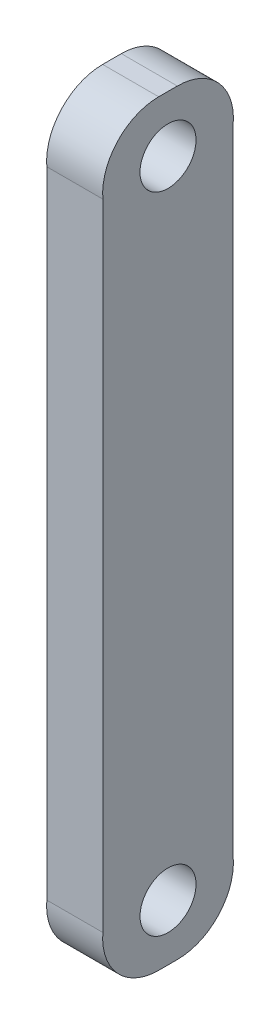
from build123d import *

# Parameters (mm, degrees)
SKETCH1_R           = 1.5
BOSS_EXTRUDE1_DEPTH = 3


with BuildPart() as part:
    # Sketch1 → Boss-Extrude1 (new body)
    with BuildSketch(Plane(origin=(0, 0, 0), x_dir=(0, 0, -1), z_dir=(1, 0, 0))):
        with BuildLine():
            Line((-0.5, -3), (0.5, -3))
            ThreePointArc((0.5, -3), (2.708238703, -2.030685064), (3.489491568, 0.250878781))
            Line((3.489491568, 0.250878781), (3.489491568, 34.250878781))
            ThreePointArc((3.489491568, 34.250878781), (2.708238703, 36.532442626), (0.5, 37.501757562))
            Line((0.5, 37.501757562), (-0.5, 37.501757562))
            ThreePointArc((-0.5, 37.501757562), (-2.708238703, 36.532442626), (-3.489491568, 34.250878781))
            Line((-3.489491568, 34.250878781), (-3.489491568, 0.250878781))
            ThreePointArc((-3.489491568, 0.250878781), (-2.708238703, -2.030685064), (-0.5, -3))
        make_face()
        Circle(SKETCH1_R, mode=Mode.SUBTRACT)
        with Locations(Location((0, 34.501757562, 0), (0, 0, 180))):
            Circle(SKETCH1_R, mode=Mode.SUBTRACT)
    extrude(amount=BOSS_EXTRUDE1_DEPTH)


solid = part.part
